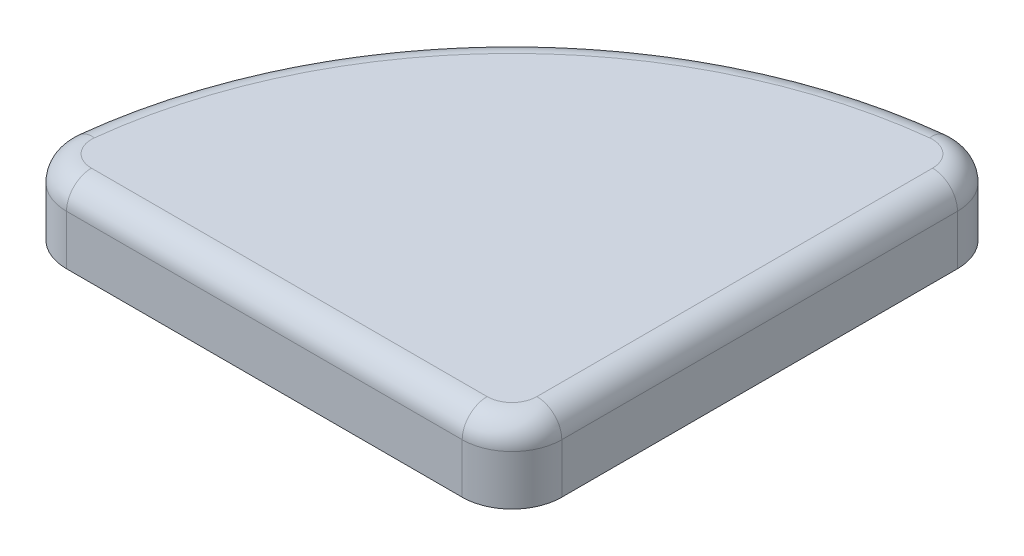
ISO-10303-21;
HEADER;
FILE_DESCRIPTION(('STEP AP214'),'2;1');
FILE_NAME('part.step','',(''),(''),'','','');
FILE_SCHEMA(('AUTOMOTIVE_DESIGN { 1 0 10303 214 1 1 1 1 }'));
ENDSEC;
DATA;
#1=APPLICATION_CONTEXT('core data for automotive mechanical design processes');
#2=APPLICATION_PROTOCOL_DEFINITION('international standard','automotive_design',2000,#1);
#3=PRODUCT_CONTEXT('',#1,'mechanical');
#4=PRODUCT('Part','Part','',(#3));
#5=PRODUCT_RELATED_PRODUCT_CATEGORY('part','',(#4));
#6=PRODUCT_DEFINITION_FORMATION('','',#4);
#7=PRODUCT_DEFINITION_CONTEXT('part definition',#1,'design');
#8=PRODUCT_DEFINITION('design','',#6,#7);
#9=PRODUCT_DEFINITION_SHAPE('','',#8);
#10=(LENGTH_UNIT() NAMED_UNIT(*) SI_UNIT(.MILLI.,.METRE.));
#11=(NAMED_UNIT(*) PLANE_ANGLE_UNIT() SI_UNIT($,.RADIAN.));
#12=(NAMED_UNIT(*) SI_UNIT($,.STERADIAN.) SOLID_ANGLE_UNIT());
#13=UNCERTAINTY_MEASURE_WITH_UNIT(LENGTH_MEASURE(1.E-05),#10,'distance_accuracy_value','');
#14=(GEOMETRIC_REPRESENTATION_CONTEXT(3) GLOBAL_UNCERTAINTY_ASSIGNED_CONTEXT((#13)) GLOBAL_UNIT_ASSIGNED_CONTEXT((#10,
#11,#12)) REPRESENTATION_CONTEXT('',''));
#15=CARTESIAN_POINT('',(0.,0.,0.));
#16=DIRECTION('',(0.,0.,1.));
#17=DIRECTION('',(1.,0.,0.));
#18=AXIS2_PLACEMENT_3D('',#15,#16,#17);
#19=CARTESIAN_POINT('',(0.,1.,0.));
#20=DIRECTION('',(0.,-1.,0.));
#21=DIRECTION('',(0.,0.,-1.));
#22=AXIS2_PLACEMENT_3D('',#19,#20,#21);
#23=PLANE('',#22);
#24=DIRECTION('',(1.,0.,0.));
#25=VECTOR('',#24,1.);
#26=CARTESIAN_POINT('',(-12.5,1.,-2.2));
#27=LINE('',#26,#25);
#28=CARTESIAN_POINT('',(-12.5,1.,-2.2));
#29=VERTEX_POINT('',#28);
#30=CARTESIAN_POINT('',(-7.50000000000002,1.,-2.2));
#31=VERTEX_POINT('',#30);
#32=EDGE_CURVE('E253',#29,#31,#27,.T.);
#33=ORIENTED_EDGE('',*,*,#32,.F.);
#34=DIRECTION('',(0.,0.,-1.));
#35=VECTOR('',#34,1.);
#36=CARTESIAN_POINT('',(-12.5,1.,-1.2));
#37=LINE('',#36,#35);
#38=CARTESIAN_POINT('',(-12.5,1.,-1.2));
#39=VERTEX_POINT('',#38);
#40=EDGE_CURVE('E217',#39,#29,#37,.T.);
#41=ORIENTED_EDGE('',*,*,#40,.F.);
#42=DIRECTION('',(-1.,0.,0.));
#43=VECTOR('',#42,1.);
#44=CARTESIAN_POINT('',(-17.8885438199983,1.,-1.19999999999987));
#45=LINE('',#44,#43);
#46=CARTESIAN_POINT('',(-17.8885438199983,1.,-1.19999999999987));
#47=VERTEX_POINT('',#46);
#48=EDGE_CURVE('E284',#39,#47,#45,.T.);
#49=ORIENTED_EDGE('',*,*,#48,.T.);
#50=CARTESIAN_POINT('',(-17.8885438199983,1.,-1.99999999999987));
#51=DIRECTION('',(0.,-1.,0.));
#52=DIRECTION('',(0.,0.,-1.));
#53=AXIS2_PLACEMENT_3D('',#50,#51,#52);
#54=CIRCLE('',#53,0.799999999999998);
#55=CARTESIAN_POINT('',(-18.6835902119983,1.,-2.08888888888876));
#56=VERTEX_POINT('',#55);
#57=EDGE_CURVE('E288',#47,#56,#54,.T.);
#58=ORIENTED_EDGE('',*,*,#57,.T.);
#59=CARTESIAN_POINT('',(0.,1.,0.));
#60=DIRECTION('',(0.,-1.,0.));
#61=DIRECTION('',(0.,0.,-1.));
#62=AXIS2_PLACEMENT_3D('',#59,#60,#61);
#63=CIRCLE('',#62,18.8);
#64=CARTESIAN_POINT('',(-2.08888888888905,1.,-18.6835902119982));
#65=VERTEX_POINT('',#64);
#66=EDGE_CURVE('E271',#56,#65,#63,.T.);
#67=ORIENTED_EDGE('',*,*,#66,.T.);
#68=CARTESIAN_POINT('',(-2.00000000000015,1.,-17.8885438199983));
#69=DIRECTION('',(0.,-1.,0.));
#70=DIRECTION('',(0.,0.,-1.));
#71=AXIS2_PLACEMENT_3D('',#68,#69,#70);
#72=CIRCLE('',#71,0.799999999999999);
#73=CARTESIAN_POINT('',(-1.20000000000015,1.,-17.8885438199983));
#74=VERTEX_POINT('',#73);
#75=EDGE_CURVE('E274',#65,#74,#72,.T.);
#76=ORIENTED_EDGE('',*,*,#75,.T.);
#77=DIRECTION('',(0.,0.,1.));
#78=VECTOR('',#77,1.);
#79=CARTESIAN_POINT('',(-1.20000000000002,1.,-2.00000000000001));
#80=LINE('',#79,#78);
#81=CARTESIAN_POINT('',(-1.20000000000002,1.,-2.00000000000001));
#82=VERTEX_POINT('',#81);
#83=EDGE_CURVE('E278',#74,#82,#80,.T.);
#84=ORIENTED_EDGE('',*,*,#83,.T.);
#85=CARTESIAN_POINT('',(-2.00000000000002,1.,-2.));
#86=DIRECTION('',(0.,-1.,0.));
#87=DIRECTION('',(0.,0.,-1.));
#88=AXIS2_PLACEMENT_3D('',#85,#86,#87);
#89=CIRCLE('',#88,0.8);
#90=CARTESIAN_POINT('',(-2.00000000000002,1.,-1.2));
#91=VERTEX_POINT('',#90);
#92=EDGE_CURVE('E281',#82,#91,#89,.T.);
#93=ORIENTED_EDGE('',*,*,#92,.T.);
#94=CARTESIAN_POINT('',(-7.50000000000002,1.,-1.2));
#95=VERTEX_POINT('',#94);
#96=EDGE_CURVE('E285',#91,#95,#45,.T.);
#97=ORIENTED_EDGE('',*,*,#96,.T.);
#98=DIRECTION('',(0.,0.,1.));
#99=VECTOR('',#98,1.);
#100=CARTESIAN_POINT('',(-7.50000000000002,1.,-1.2));
#101=LINE('',#100,#99);
#102=EDGE_CURVE('E244',#31,#95,#101,.T.);
#103=ORIENTED_EDGE('',*,*,#102,.F.);
#104=EDGE_LOOP('',(#33,#41,#49,#58,#67,#76,#84,#93,#97,#103));
#105=FACE_BOUND('',#104,.T.);
#106=DIRECTION('',(1.,0.,0.));
#107=VECTOR('',#106,1.);
#108=CARTESIAN_POINT('',(-11.3,1.,-12.1499999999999));
#109=LINE('',#108,#107);
#110=CARTESIAN_POINT('',(-11.3,1.,-12.1499999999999));
#111=VERTEX_POINT('',#110);
#112=CARTESIAN_POINT('',(-8.70000000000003,1.,-12.1499999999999));
#113=VERTEX_POINT('',#112);
#114=EDGE_CURVE('E213',#111,#113,#109,.T.);
#115=ORIENTED_EDGE('',*,*,#114,.F.);
#116=DIRECTION('',(0.,0.,-1.));
#117=VECTOR('',#116,1.);
#118=CARTESIAN_POINT('',(-11.3,1.,-7.84999999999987));
#119=LINE('',#118,#117);
#120=CARTESIAN_POINT('',(-11.3,1.,-7.84999999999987));
#121=VERTEX_POINT('',#120);
#122=EDGE_CURVE('E221',#121,#111,#119,.T.);
#123=ORIENTED_EDGE('',*,*,#122,.F.);
#124=DIRECTION('',(-1.,0.,0.));
#125=VECTOR('',#124,1.);
#126=CARTESIAN_POINT('',(-11.3,1.,-7.84999999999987));
#127=LINE('',#126,#125);
#128=CARTESIAN_POINT('',(-8.70000000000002,1.,-7.84999999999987));
#129=VERTEX_POINT('',#128);
#130=EDGE_CURVE('E232',#129,#121,#127,.T.);
#131=ORIENTED_EDGE('',*,*,#130,.F.);
#132=DIRECTION('',(0.,0.,1.));
#133=VECTOR('',#132,1.);
#134=CARTESIAN_POINT('',(-8.70000000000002,1.,-7.84999999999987));
#135=LINE('',#134,#133);
#136=EDGE_CURVE('E230',#113,#129,#135,.T.);
#137=ORIENTED_EDGE('',*,*,#136,.F.);
#138=EDGE_LOOP('',(#115,#123,#131,#137));
#139=FACE_BOUND('',#138,.T.);
#140=ADVANCED_FACE('F37',(#105,#139),#23,.T.);
#141=CARTESIAN_POINT('',(-17.8885438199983,1.,-1.19999999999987));
#142=DIRECTION('',(0.,0.,1.));
#143=DIRECTION('',(1.,0.,0.));
#144=AXIS2_PLACEMENT_3D('',#141,#142,#143);
#145=PLANE('',#144);
#146=DIRECTION('',(0.,1.,0.));
#147=VECTOR('',#146,1.);
#148=CARTESIAN_POINT('',(-12.5,-1.,-1.2));
#149=LINE('',#148,#147);
#150=CARTESIAN_POINT('',(-12.5,0.,-1.2));
#151=VERTEX_POINT('',#150);
#152=EDGE_CURVE('E250',#151,#39,#149,.T.);
#153=ORIENTED_EDGE('',*,*,#152,.F.);
#154=DIRECTION('',(-1.,0.,0.));
#155=VECTOR('',#154,1.);
#156=CARTESIAN_POINT('',(-17.8885438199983,0.,-1.19999999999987));
#157=LINE('',#156,#155);
#158=CARTESIAN_POINT('',(-17.8885438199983,0.,-1.19999999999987));
#159=VERTEX_POINT('',#158);
#160=EDGE_CURVE('E302',#151,#159,#157,.T.);
#161=ORIENTED_EDGE('',*,*,#160,.T.);
#162=DIRECTION('',(0.,-1.,0.));
#163=VECTOR('',#162,1.);
#164=CARTESIAN_POINT('',(-17.8885438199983,1.,-1.19999999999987));
#165=LINE('',#164,#163);
#166=EDGE_CURVE('E311',#47,#159,#165,.T.);
#167=ORIENTED_EDGE('',*,*,#166,.F.);
#168=ORIENTED_EDGE('',*,*,#48,.F.);
#169=EDGE_LOOP('',(#153,#161,#167,#168));
#170=FACE_BOUND('',#169,.T.);
#171=ADVANCED_FACE('F443',(#170),#145,.F.);
#172=DIRECTION('',(0.,1.,0.));
#173=VECTOR('',#172,1.);
#174=CARTESIAN_POINT('',(-7.50000000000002,-1.,-1.2));
#175=LINE('',#174,#173);
#176=CARTESIAN_POINT('',(-7.50000000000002,0.,-1.2));
#177=VERTEX_POINT('',#176);
#178=EDGE_CURVE('E260',#177,#95,#175,.T.);
#179=ORIENTED_EDGE('',*,*,#178,.T.);
#180=ORIENTED_EDGE('',*,*,#96,.F.);
#181=DIRECTION('',(0.,-1.,0.));
#182=VECTOR('',#181,1.);
#183=CARTESIAN_POINT('',(-2.00000000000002,1.,-1.2));
#184=LINE('',#183,#182);
#185=CARTESIAN_POINT('',(-2.00000000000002,0.,-1.2));
#186=VERTEX_POINT('',#185);
#187=EDGE_CURVE('E314',#91,#186,#184,.T.);
#188=ORIENTED_EDGE('',*,*,#187,.T.);
#189=EDGE_CURVE('E303',#186,#177,#157,.T.);
#190=ORIENTED_EDGE('',*,*,#189,.T.);
#191=EDGE_LOOP('',(#179,#180,#188,#190));
#192=FACE_BOUND('',#191,.T.);
#193=ADVANCED_FACE('F450',(#192),#145,.F.);
#194=CARTESIAN_POINT('',(0.,3.,0.));
#195=DIRECTION('',(0.,-1.,0.));
#196=DIRECTION('',(0.,0.,-1.));
#197=AXIS2_PLACEMENT_3D('',#194,#195,#196);
#198=CYLINDRICAL_SURFACE('',#197,20.);
#199=DIRECTION('',(0.,-1.,0.));
#200=VECTOR('',#199,1.);
#201=CARTESIAN_POINT('',(-19.8761597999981,3.,-2.22222222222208));
#202=LINE('',#201,#200);
#203=CARTESIAN_POINT('',(-19.8761597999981,2.,-2.22222222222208));
#204=VERTEX_POINT('',#203);
#205=CARTESIAN_POINT('',(-19.8761597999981,0.,-2.22222222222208));
#206=VERTEX_POINT('',#205);
#207=EDGE_CURVE('E351',#204,#206,#202,.T.);
#208=ORIENTED_EDGE('',*,*,#207,.F.);
#209=CARTESIAN_POINT('',(0.,2.,0.));
#210=DIRECTION('',(0.,1.,0.));
#211=DIRECTION('',(0.,0.,1.));
#212=AXIS2_PLACEMENT_3D('',#209,#210,#211);
#213=CIRCLE('',#212,20.);
#214=CARTESIAN_POINT('',(-2.22222222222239,2.,-19.8761597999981));
#215=VERTEX_POINT('',#214);
#216=EDGE_CURVE('E377',#204,#215,#213,.F.);
#217=ORIENTED_EDGE('',*,*,#216,.T.);
#218=DIRECTION('',(0.,-1.,0.));
#219=VECTOR('',#218,1.);
#220=CARTESIAN_POINT('',(-2.22222222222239,3.,-19.8761597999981));
#221=LINE('',#220,#219);
#222=CARTESIAN_POINT('',(-2.22222222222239,0.,-19.8761597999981));
#223=VERTEX_POINT('',#222);
#224=EDGE_CURVE('E341',#215,#223,#221,.T.);
#225=ORIENTED_EDGE('',*,*,#224,.T.);
#226=CARTESIAN_POINT('',(0.,0.,0.));
#227=DIRECTION('',(0.,1.,0.));
#228=DIRECTION('',(0.,0.,1.));
#229=AXIS2_PLACEMENT_3D('',#226,#227,#228);
#230=CIRCLE('',#229,20.);
#231=EDGE_CURVE('E322',#223,#206,#230,.T.);
#232=ORIENTED_EDGE('',*,*,#231,.T.);
#233=EDGE_LOOP('',(#208,#217,#225,#232));
#234=FACE_BOUND('',#233,.T.);
#235=ADVANCED_FACE('F508',(#234),#198,.T.);
#236=CARTESIAN_POINT('',(-17.8885438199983,3.,-1.99999999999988));
#237=DIRECTION('',(0.,-1.,0.));
#238=DIRECTION('',(0.,0.,-1.));
#239=AXIS2_PLACEMENT_3D('',#236,#237,#238);
#240=CYLINDRICAL_SURFACE('',#239,2.);
#241=DIRECTION('',(0.,-1.,0.));
#242=VECTOR('',#241,1.);
#243=CARTESIAN_POINT('',(-17.8885438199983,3.,1.25333771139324E-13));
#244=LINE('',#243,#242);
#245=CARTESIAN_POINT('',(-17.8885438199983,2.,1.25333771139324E-13));
#246=VERTEX_POINT('',#245);
#247=CARTESIAN_POINT('',(-17.8885438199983,0.,1.25333771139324E-13));
#248=VERTEX_POINT('',#247);
#249=EDGE_CURVE('E349',#246,#248,#244,.T.);
#250=ORIENTED_EDGE('',*,*,#249,.F.);
#251=CARTESIAN_POINT('',(-17.8885438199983,2.,-1.99999999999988));
#252=DIRECTION('',(0.,1.,0.));
#253=DIRECTION('',(0.,0.,1.));
#254=AXIS2_PLACEMENT_3D('',#251,#252,#253);
#255=CIRCLE('',#254,2.);
#256=EDGE_CURVE('E375',#246,#204,#255,.F.);
#257=ORIENTED_EDGE('',*,*,#256,.T.);
#258=ORIENTED_EDGE('',*,*,#207,.T.);
#259=CARTESIAN_POINT('',(-17.8885438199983,0.,-1.99999999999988));
#260=DIRECTION('',(0.,1.,0.));
#261=DIRECTION('',(0.,0.,1.));
#262=AXIS2_PLACEMENT_3D('',#259,#260,#261);
#263=CIRCLE('',#262,2.);
#264=EDGE_CURVE('E325',#206,#248,#263,.T.);
#265=ORIENTED_EDGE('',*,*,#264,.T.);
#266=EDGE_LOOP('',(#250,#257,#258,#265));
#267=FACE_BOUND('',#266,.T.);
#268=ADVANCED_FACE('F504',(#267),#240,.T.);
#269=CARTESIAN_POINT('',(-2.00000000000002,3.,0.));
#270=DIRECTION('',(0.,0.,-1.));
#271=DIRECTION('',(-1.,0.,0.));
#272=AXIS2_PLACEMENT_3D('',#269,#270,#271);
#273=PLANE('',#272);
#274=DIRECTION('',(0.,-1.,0.));
#275=VECTOR('',#274,1.);
#276=CARTESIAN_POINT('',(-2.00000000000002,3.,0.));
#277=LINE('',#276,#275);
#278=CARTESIAN_POINT('',(-2.00000000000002,2.,0.));
#279=VERTEX_POINT('',#278);
#280=CARTESIAN_POINT('',(-2.00000000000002,0.,0.));
#281=VERTEX_POINT('',#280);
#282=EDGE_CURVE('E347',#279,#281,#277,.T.);
#283=ORIENTED_EDGE('',*,*,#282,.F.);
#284=DIRECTION('',(1.,0.,0.));
#285=VECTOR('',#284,1.);
#286=CARTESIAN_POINT('',(-17.8885438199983,2.,1.24700109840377E-13));
#287=LINE('',#286,#285);
#288=EDGE_CURVE('E373',#279,#246,#287,.F.);
#289=ORIENTED_EDGE('',*,*,#288,.T.);
#290=ORIENTED_EDGE('',*,*,#249,.T.);
#291=DIRECTION('',(1.,0.,0.));
#292=VECTOR('',#291,1.);
#293=CARTESIAN_POINT('',(-2.00000000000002,0.,0.));
#294=LINE('',#293,#292);
#295=EDGE_CURVE('E329',#248,#281,#294,.T.);
#296=ORIENTED_EDGE('',*,*,#295,.T.);
#297=EDGE_LOOP('',(#283,#289,#290,#296));
#298=FACE_BOUND('',#297,.T.);
#299=ADVANCED_FACE('F500',(#298),#273,.F.);
#300=CARTESIAN_POINT('',(-2.00000000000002,3.,-1.99999999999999));
#301=DIRECTION('',(0.,-1.,0.));
#302=DIRECTION('',(0.,0.,-1.));
#303=AXIS2_PLACEMENT_3D('',#300,#301,#302);
#304=CYLINDRICAL_SURFACE('',#303,1.99999999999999);
#305=DIRECTION('',(0.,-1.,0.));
#306=VECTOR('',#305,1.);
#307=CARTESIAN_POINT('',(0.,3.,-2.00000000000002));
#308=LINE('',#307,#306);
#309=CARTESIAN_POINT('',(0.,2.,-2.00000000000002));
#310=VERTEX_POINT('',#309);
#311=CARTESIAN_POINT('',(0.,0.,-2.00000000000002));
#312=VERTEX_POINT('',#311);
#313=EDGE_CURVE('E345',#310,#312,#308,.T.);
#314=ORIENTED_EDGE('',*,*,#313,.F.);
#315=CARTESIAN_POINT('',(-2.00000000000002,2.,-1.99999999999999));
#316=DIRECTION('',(0.,1.,0.));
#317=DIRECTION('',(0.,0.,1.));
#318=AXIS2_PLACEMENT_3D('',#315,#316,#317);
#319=CIRCLE('',#318,1.99999999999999);
#320=EDGE_CURVE('E371',#310,#279,#319,.F.);
#321=ORIENTED_EDGE('',*,*,#320,.T.);
#322=ORIENTED_EDGE('',*,*,#282,.T.);
#323=CARTESIAN_POINT('',(-2.00000000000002,0.,-1.99999999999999));
#324=DIRECTION('',(0.,1.,0.));
#325=DIRECTION('',(0.,0.,1.));
#326=AXIS2_PLACEMENT_3D('',#323,#324,#325);
#327=CIRCLE('',#326,1.99999999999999);
#328=EDGE_CURVE('E332',#281,#312,#327,.T.);
#329=ORIENTED_EDGE('',*,*,#328,.T.);
#330=EDGE_LOOP('',(#314,#321,#322,#329));
#331=FACE_BOUND('',#330,.T.);
#332=ADVANCED_FACE('F496',(#331),#304,.T.);
#333=CARTESIAN_POINT('',(-1.49619899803E-13,3.,-17.8885438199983));
#334=DIRECTION('',(-1.,0.,0.));
#335=DIRECTION('',(0.,0.,1.));
#336=AXIS2_PLACEMENT_3D('',#333,#334,#335);
#337=PLANE('',#336);
#338=DIRECTION('',(0.,-1.,0.));
#339=VECTOR('',#338,1.);
#340=CARTESIAN_POINT('',(-1.49619899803E-13,3.,-17.8885438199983));
#341=LINE('',#340,#339);
#342=CARTESIAN_POINT('',(-1.49619899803E-13,2.,-17.8885438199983));
#343=VERTEX_POINT('',#342);
#344=CARTESIAN_POINT('',(-1.49619899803E-13,0.,-17.8885438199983));
#345=VERTEX_POINT('',#344);
#346=EDGE_CURVE('E343',#343,#345,#341,.T.);
#347=ORIENTED_EDGE('',*,*,#346,.F.);
#348=DIRECTION('',(0.,0.,-1.));
#349=VECTOR('',#348,1.);
#350=CARTESIAN_POINT('',(0.,2.,-2.00000000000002));
#351=LINE('',#350,#349);
#352=EDGE_CURVE('E369',#343,#310,#351,.F.);
#353=ORIENTED_EDGE('',*,*,#352,.T.);
#354=ORIENTED_EDGE('',*,*,#313,.T.);
#355=DIRECTION('',(0.,0.,-1.));
#356=VECTOR('',#355,1.);
#357=CARTESIAN_POINT('',(-1.49619899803E-13,0.,-17.8885438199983));
#358=LINE('',#357,#356);
#359=EDGE_CURVE('E335',#312,#345,#358,.T.);
#360=ORIENTED_EDGE('',*,*,#359,.T.);
#361=EDGE_LOOP('',(#347,#353,#354,#360));
#362=FACE_BOUND('',#361,.T.);
#363=ADVANCED_FACE('F492',(#362),#337,.F.);
#364=CARTESIAN_POINT('',(-2.00000000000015,3.,-17.8885438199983));
#365=DIRECTION('',(0.,-1.,0.));
#366=DIRECTION('',(0.,0.,-1.));
#367=AXIS2_PLACEMENT_3D('',#364,#365,#366);
#368=CYLINDRICAL_SURFACE('',#367,2.);
#369=ORIENTED_EDGE('',*,*,#224,.F.);
#370=CARTESIAN_POINT('',(-2.00000000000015,2.,-17.8885438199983));
#371=DIRECTION('',(0.,1.,0.));
#372=DIRECTION('',(0.,0.,1.));
#373=AXIS2_PLACEMENT_3D('',#370,#371,#372);
#374=CIRCLE('',#373,2.);
#375=EDGE_CURVE('E366',#215,#343,#374,.F.);
#376=ORIENTED_EDGE('',*,*,#375,.T.);
#377=ORIENTED_EDGE('',*,*,#346,.T.);
#378=CARTESIAN_POINT('',(-2.00000000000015,0.,-17.8885438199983));
#379=DIRECTION('',(0.,1.,0.));
#380=DIRECTION('',(0.,0.,1.));
#381=AXIS2_PLACEMENT_3D('',#378,#379,#380);
#382=CIRCLE('',#381,2.);
#383=EDGE_CURVE('E338',#345,#223,#382,.T.);
#384=ORIENTED_EDGE('',*,*,#383,.T.);
#385=EDGE_LOOP('',(#369,#376,#377,#384));
#386=FACE_BOUND('',#385,.T.);
#387=ADVANCED_FACE('F484',(#386),#368,.T.);
#388=CARTESIAN_POINT('',(0.,3.,0.));
#389=DIRECTION('',(0.,1.,0.));
#390=DIRECTION('',(0.,0.,1.));
#391=AXIS2_PLACEMENT_3D('',#388,#389,#390);
#392=PLANE('',#391);
#393=DIRECTION('',(0.,0.,-1.));
#394=VECTOR('',#393,1.);
#395=CARTESIAN_POINT('',(-1.00000000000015,3.,-17.8885438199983));
#396=LINE('',#395,#394);
#397=CARTESIAN_POINT('',(-1.00000000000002,3.,-2.00000000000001));
#398=VERTEX_POINT('',#397);
#399=CARTESIAN_POINT('',(-1.00000000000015,3.,-17.8885438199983));
#400=VERTEX_POINT('',#399);
#401=EDGE_CURVE('E361',#398,#400,#396,.T.);
#402=ORIENTED_EDGE('',*,*,#401,.T.);
#403=CARTESIAN_POINT('',(-2.00000000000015,3.,-17.8885438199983));
#404=DIRECTION('',(0.,1.,0.));
#405=DIRECTION('',(0.,0.,1.));
#406=AXIS2_PLACEMENT_3D('',#403,#404,#405);
#407=CIRCLE('',#406,1.);
#408=CARTESIAN_POINT('',(-2.11111111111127,3.,-18.8823518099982));
#409=VERTEX_POINT('',#408);
#410=EDGE_CURVE('E363',#400,#409,#407,.T.);
#411=ORIENTED_EDGE('',*,*,#410,.T.);
#412=CARTESIAN_POINT('',(0.,3.,0.));
#413=DIRECTION('',(0.,1.,0.));
#414=DIRECTION('',(0.,0.,1.));
#415=AXIS2_PLACEMENT_3D('',#412,#413,#414);
#416=CIRCLE('',#415,19.);
#417=CARTESIAN_POINT('',(-18.8823518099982,3.,-2.11111111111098));
#418=VERTEX_POINT('',#417);
#419=EDGE_CURVE('E353',#409,#418,#416,.T.);
#420=ORIENTED_EDGE('',*,*,#419,.T.);
#421=CARTESIAN_POINT('',(-17.8885438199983,3.,-1.99999999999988));
#422=DIRECTION('',(0.,1.,0.));
#423=DIRECTION('',(0.,0.,1.));
#424=AXIS2_PLACEMENT_3D('',#421,#422,#423);
#425=CIRCLE('',#424,1.);
#426=CARTESIAN_POINT('',(-17.8885438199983,3.,-0.999999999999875));
#427=VERTEX_POINT('',#426);
#428=EDGE_CURVE('E355',#418,#427,#425,.T.);
#429=ORIENTED_EDGE('',*,*,#428,.T.);
#430=DIRECTION('',(1.,0.,0.));
#431=VECTOR('',#430,1.);
#432=CARTESIAN_POINT('',(-2.00000000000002,3.,-1.));
#433=LINE('',#432,#431);
#434=CARTESIAN_POINT('',(-2.00000000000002,3.,-1.));
#435=VERTEX_POINT('',#434);
#436=EDGE_CURVE('E357',#427,#435,#433,.T.);
#437=ORIENTED_EDGE('',*,*,#436,.T.);
#438=CARTESIAN_POINT('',(-2.00000000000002,3.,-1.99999999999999));
#439=DIRECTION('',(0.,1.,0.));
#440=DIRECTION('',(0.,0.,1.));
#441=AXIS2_PLACEMENT_3D('',#438,#439,#440);
#442=CIRCLE('',#441,0.999999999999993);
#443=EDGE_CURVE('E359',#435,#398,#442,.T.);
#444=ORIENTED_EDGE('',*,*,#443,.T.);
#445=EDGE_LOOP('',(#402,#411,#420,#429,#437,#444));
#446=FACE_BOUND('',#445,.T.);
#447=ADVANCED_FACE('F480',(#446),#392,.T.);
#448=CARTESIAN_POINT('',(0.,0.,0.));
#449=DIRECTION('',(0.,1.,0.));
#450=DIRECTION('',(0.,0.,1.));
#451=AXIS2_PLACEMENT_3D('',#448,#449,#450);
#452=PLANE('',#451);
#453=CARTESIAN_POINT('',(-2.00000000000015,0.,-17.8885438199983));
#454=DIRECTION('',(0.,-1.,0.));
#455=DIRECTION('',(0.,0.,-1.));
#456=AXIS2_PLACEMENT_3D('',#453,#454,#455);
#457=CIRCLE('',#456,0.799999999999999);
#458=CARTESIAN_POINT('',(-2.08888888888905,0.,-18.6835902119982));
#459=VERTEX_POINT('',#458);
#460=CARTESIAN_POINT('',(-1.20000000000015,0.,-17.8885438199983));
#461=VERTEX_POINT('',#460);
#462=EDGE_CURVE('E293',#459,#461,#457,.T.);
#463=ORIENTED_EDGE('',*,*,#462,.F.);
#464=CARTESIAN_POINT('',(0.,0.,0.));
#465=DIRECTION('',(0.,-1.,0.));
#466=DIRECTION('',(0.,0.,-1.));
#467=AXIS2_PLACEMENT_3D('',#464,#465,#466);
#468=CIRCLE('',#467,18.8);
#469=CARTESIAN_POINT('',(-18.6835902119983,0.,-2.08888888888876));
#470=VERTEX_POINT('',#469);
#471=EDGE_CURVE('E270',#470,#459,#468,.T.);
#472=ORIENTED_EDGE('',*,*,#471,.F.);
#473=CARTESIAN_POINT('',(-17.8885438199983,0.,-1.99999999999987));
#474=DIRECTION('',(0.,-1.,0.));
#475=DIRECTION('',(0.,0.,-1.));
#476=AXIS2_PLACEMENT_3D('',#473,#474,#475);
#477=CIRCLE('',#476,0.799999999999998);
#478=EDGE_CURVE('E275',#159,#470,#477,.T.);
#479=ORIENTED_EDGE('',*,*,#478,.F.);
#480=ORIENTED_EDGE('',*,*,#160,.F.);
#481=DIRECTION('',(-1.,0.,0.));
#482=VECTOR('',#481,1.);
#483=CARTESIAN_POINT('',(0.,0.,-1.2));
#484=LINE('',#483,#482);
#485=EDGE_CURVE('E268',#177,#151,#484,.T.);
#486=ORIENTED_EDGE('',*,*,#485,.F.);
#487=ORIENTED_EDGE('',*,*,#189,.F.);
#488=CARTESIAN_POINT('',(-2.00000000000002,0.,-2.));
#489=DIRECTION('',(0.,-1.,0.));
#490=DIRECTION('',(0.,0.,-1.));
#491=AXIS2_PLACEMENT_3D('',#488,#489,#490);
#492=CIRCLE('',#491,0.8);
#493=CARTESIAN_POINT('',(-1.20000000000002,0.,-2.00000000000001));
#494=VERTEX_POINT('',#493);
#495=EDGE_CURVE('E299',#494,#186,#492,.T.);
#496=ORIENTED_EDGE('',*,*,#495,.F.);
#497=DIRECTION('',(0.,0.,1.));
#498=VECTOR('',#497,1.);
#499=CARTESIAN_POINT('',(-1.20000000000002,0.,-2.00000000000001));
#500=LINE('',#499,#498);
#501=EDGE_CURVE('E296',#461,#494,#500,.T.);
#502=ORIENTED_EDGE('',*,*,#501,.F.);
#503=EDGE_LOOP('',(#463,#472,#479,#480,#486,#487,#496,#502));
#504=FACE_BOUND('',#503,.T.);
#505=ORIENTED_EDGE('',*,*,#231,.F.);
#506=ORIENTED_EDGE('',*,*,#383,.F.);
#507=ORIENTED_EDGE('',*,*,#359,.F.);
#508=ORIENTED_EDGE('',*,*,#328,.F.);
#509=ORIENTED_EDGE('',*,*,#295,.F.);
#510=ORIENTED_EDGE('',*,*,#264,.F.);
#511=EDGE_LOOP('',(#505,#506,#507,#508,#509,#510));
#512=FACE_BOUND('',#511,.T.);
#513=ADVANCED_FACE('F483',(#504,#512),#452,.F.);
#514=CARTESIAN_POINT('',(0.,2.,-1.00000000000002));
#515=DIRECTION('',(-1.,0.,0.));
#516=DIRECTION('',(0.,0.,1.));
#517=AXIS2_PLACEMENT_3D('',#514,#515,#516);
#518=CYLINDRICAL_SURFACE('',#517,1.);
#519=CARTESIAN_POINT('',(-17.8885438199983,2.,-0.999999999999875));
#520=DIRECTION('',(-1.,0.,0.));
#521=DIRECTION('',(0.,0.,1.));
#522=AXIS2_PLACEMENT_3D('',#519,#520,#521);
#523=CIRCLE('',#522,1.);
#524=EDGE_CURVE('E389',#246,#427,#523,.T.);
#525=ORIENTED_EDGE('',*,*,#524,.F.);
#526=ORIENTED_EDGE('',*,*,#288,.F.);
#527=CARTESIAN_POINT('',(-2.00000000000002,2.,-1.));
#528=DIRECTION('',(1.,0.,0.));
#529=DIRECTION('',(0.,0.,-1.));
#530=AXIS2_PLACEMENT_3D('',#527,#528,#529);
#531=CIRCLE('',#530,1.);
#532=EDGE_CURVE('E326',#435,#279,#531,.T.);
#533=ORIENTED_EDGE('',*,*,#532,.F.);
#534=ORIENTED_EDGE('',*,*,#436,.F.);
#535=EDGE_LOOP('',(#525,#526,#533,#534));
#536=FACE_BOUND('',#535,.T.);
#537=ADVANCED_FACE('F488',(#536),#518,.T.);
#538=CARTESIAN_POINT('',(-2.00000000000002,2.,-1.99999999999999));
#539=DIRECTION('',(0.,1.,0.));
#540=DIRECTION('',(0.,0.,1.));
#541=AXIS2_PLACEMENT_3D('',#538,#539,#540);
#542=DEGENERATE_TOROIDAL_SURFACE('',#541,0.999999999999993,1.,.T.);
#543=ORIENTED_EDGE('',*,*,#532,.T.);
#544=ORIENTED_EDGE('',*,*,#320,.F.);
#545=CARTESIAN_POINT('',(-1.00000000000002,2.,-2.00000000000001));
#546=DIRECTION('',(0.,0.,-1.));
#547=DIRECTION('',(-1.,0.,0.));
#548=AXIS2_PLACEMENT_3D('',#545,#546,#547);
#549=CIRCLE('',#548,1.);
#550=EDGE_CURVE('E386',#398,#310,#549,.T.);
#551=ORIENTED_EDGE('',*,*,#550,.F.);
#552=ORIENTED_EDGE('',*,*,#443,.F.);
#553=EDGE_LOOP('',(#543,#544,#551,#552));
#554=FACE_BOUND('',#553,.T.);
#555=ADVANCED_FACE('F527',(#554),#542,.T.);
#556=CARTESIAN_POINT('',(-17.8885438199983,2.,-1.99999999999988));
#557=DIRECTION('',(0.,1.,0.));
#558=DIRECTION('',(0.,0.,1.));
#559=AXIS2_PLACEMENT_3D('',#556,#557,#558);
#560=TOROIDAL_SURFACE('',#559,1.,1.);
#561=ORIENTED_EDGE('',*,*,#524,.T.);
#562=ORIENTED_EDGE('',*,*,#428,.F.);
#563=CARTESIAN_POINT('',(-18.8823518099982,2.,-2.11111111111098));
#564=DIRECTION('',(0.111111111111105,0.,-0.993807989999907));
#565=DIRECTION('',(-0.993807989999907,0.,-0.111111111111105));
#566=AXIS2_PLACEMENT_3D('',#563,#564,#565);
#567=CIRCLE('',#566,1.);
#568=EDGE_CURVE('E383',#204,#418,#567,.T.);
#569=ORIENTED_EDGE('',*,*,#568,.F.);
#570=ORIENTED_EDGE('',*,*,#256,.F.);
#571=EDGE_LOOP('',(#561,#562,#569,#570));
#572=FACE_BOUND('',#571,.T.);
#573=ADVANCED_FACE('F523',(#572),#560,.T.);
#574=CARTESIAN_POINT('',(-1.,2.,0.));
#575=DIRECTION('',(0.,0.,1.));
#576=DIRECTION('',(1.,0.,0.));
#577=AXIS2_PLACEMENT_3D('',#574,#575,#576);
#578=CYLINDRICAL_SURFACE('',#577,1.);
#579=ORIENTED_EDGE('',*,*,#550,.T.);
#580=ORIENTED_EDGE('',*,*,#352,.F.);
#581=CARTESIAN_POINT('',(-1.00000000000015,2.,-17.8885438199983));
#582=DIRECTION('',(0.,0.,-1.));
#583=DIRECTION('',(-1.,0.,0.));
#584=AXIS2_PLACEMENT_3D('',#581,#582,#583);
#585=CIRCLE('',#584,1.);
#586=EDGE_CURVE('E381',#400,#343,#585,.T.);
#587=ORIENTED_EDGE('',*,*,#586,.F.);
#588=ORIENTED_EDGE('',*,*,#401,.F.);
#589=EDGE_LOOP('',(#579,#580,#587,#588));
#590=FACE_BOUND('',#589,.T.);
#591=ADVANCED_FACE('F519',(#590),#578,.T.);
#592=CARTESIAN_POINT('',(0.,2.,0.));
#593=DIRECTION('',(0.,1.,0.));
#594=DIRECTION('',(0.,0.,1.));
#595=AXIS2_PLACEMENT_3D('',#592,#593,#594);
#596=TOROIDAL_SURFACE('',#595,19.,1.);
#597=ORIENTED_EDGE('',*,*,#568,.T.);
#598=ORIENTED_EDGE('',*,*,#419,.F.);
#599=CARTESIAN_POINT('',(-2.11111111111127,2.,-18.8823518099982));
#600=DIRECTION('',(0.993807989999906,0.,-0.11111111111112));
#601=DIRECTION('',(-0.11111111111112,0.,-0.993807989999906));
#602=AXIS2_PLACEMENT_3D('',#599,#600,#601);
#603=CIRCLE('',#602,1.);
#604=EDGE_CURVE('E310',#215,#409,#603,.T.);
#605=ORIENTED_EDGE('',*,*,#604,.F.);
#606=ORIENTED_EDGE('',*,*,#216,.F.);
#607=EDGE_LOOP('',(#597,#598,#605,#606));
#608=FACE_BOUND('',#607,.T.);
#609=ADVANCED_FACE('F515',(#608),#596,.T.);
#610=CARTESIAN_POINT('',(-2.00000000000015,2.,-17.8885438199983));
#611=DIRECTION('',(0.,1.,0.));
#612=DIRECTION('',(0.,0.,1.));
#613=AXIS2_PLACEMENT_3D('',#610,#611,#612);
#614=TOROIDAL_SURFACE('',#613,1.,1.);
#615=ORIENTED_EDGE('',*,*,#586,.T.);
#616=ORIENTED_EDGE('',*,*,#375,.F.);
#617=ORIENTED_EDGE('',*,*,#604,.T.);
#618=ORIENTED_EDGE('',*,*,#410,.F.);
#619=EDGE_LOOP('',(#615,#616,#617,#618));
#620=FACE_BOUND('',#619,.T.);
#621=ADVANCED_FACE('F478',(#620),#614,.T.);
#622=CARTESIAN_POINT('',(0.,1.,0.));
#623=DIRECTION('',(0.,-1.,0.));
#624=DIRECTION('',(0.,0.,-1.));
#625=AXIS2_PLACEMENT_3D('',#622,#623,#624);
#626=CYLINDRICAL_SURFACE('',#625,18.8);
#627=ORIENTED_EDGE('',*,*,#471,.T.);
#628=DIRECTION('',(0.,-1.,0.));
#629=VECTOR('',#628,1.);
#630=CARTESIAN_POINT('',(-2.08888888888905,1.,-18.6835902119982));
#631=LINE('',#630,#629);
#632=EDGE_CURVE('E291',#65,#459,#631,.T.);
#633=ORIENTED_EDGE('',*,*,#632,.F.);
#634=ORIENTED_EDGE('',*,*,#66,.F.);
#635=DIRECTION('',(0.,-1.,0.));
#636=VECTOR('',#635,1.);
#637=CARTESIAN_POINT('',(-18.6835902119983,1.,-2.08888888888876));
#638=LINE('',#637,#636);
#639=EDGE_CURVE('E308',#56,#470,#638,.T.);
#640=ORIENTED_EDGE('',*,*,#639,.T.);
#641=EDGE_LOOP('',(#627,#633,#634,#640));
#642=FACE_BOUND('',#641,.T.);
#643=ADVANCED_FACE('F461',(#642),#626,.F.);
#644=CARTESIAN_POINT('',(-17.8885438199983,1.,-1.99999999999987));
#645=DIRECTION('',(0.,-1.,0.));
#646=DIRECTION('',(0.,0.,-1.));
#647=AXIS2_PLACEMENT_3D('',#644,#645,#646);
#648=CYLINDRICAL_SURFACE('',#647,0.799999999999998);
#649=ORIENTED_EDGE('',*,*,#478,.T.);
#650=ORIENTED_EDGE('',*,*,#639,.F.);
#651=ORIENTED_EDGE('',*,*,#57,.F.);
#652=ORIENTED_EDGE('',*,*,#166,.T.);
#653=EDGE_LOOP('',(#649,#650,#651,#652));
#654=FACE_BOUND('',#653,.T.);
#655=ADVANCED_FACE('F458',(#654),#648,.F.);
#656=CARTESIAN_POINT('',(-2.00000000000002,1.,-2.));
#657=DIRECTION('',(0.,-1.,0.));
#658=DIRECTION('',(0.,0.,-1.));
#659=AXIS2_PLACEMENT_3D('',#656,#657,#658);
#660=CYLINDRICAL_SURFACE('',#659,0.8);
#661=ORIENTED_EDGE('',*,*,#495,.T.);
#662=ORIENTED_EDGE('',*,*,#187,.F.);
#663=ORIENTED_EDGE('',*,*,#92,.F.);
#664=DIRECTION('',(0.,-1.,0.));
#665=VECTOR('',#664,1.);
#666=CARTESIAN_POINT('',(-1.20000000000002,1.,-2.00000000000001));
#667=LINE('',#666,#665);
#668=EDGE_CURVE('E316',#82,#494,#667,.T.);
#669=ORIENTED_EDGE('',*,*,#668,.T.);
#670=EDGE_LOOP('',(#661,#662,#663,#669));
#671=FACE_BOUND('',#670,.T.);
#672=ADVANCED_FACE('F460',(#671),#660,.F.);
#673=CARTESIAN_POINT('',(-1.20000000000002,1.,-2.00000000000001));
#674=DIRECTION('',(1.,0.,0.));
#675=DIRECTION('',(0.,0.,-1.));
#676=AXIS2_PLACEMENT_3D('',#673,#674,#675);
#677=PLANE('',#676);
#678=ORIENTED_EDGE('',*,*,#501,.T.);
#679=ORIENTED_EDGE('',*,*,#668,.F.);
#680=ORIENTED_EDGE('',*,*,#83,.F.);
#681=DIRECTION('',(0.,-1.,0.));
#682=VECTOR('',#681,1.);
#683=CARTESIAN_POINT('',(-1.20000000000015,1.,-17.8885438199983));
#684=LINE('',#683,#682);
#685=EDGE_CURVE('E318',#74,#461,#684,.T.);
#686=ORIENTED_EDGE('',*,*,#685,.T.);
#687=EDGE_LOOP('',(#678,#679,#680,#686));
#688=FACE_BOUND('',#687,.T.);
#689=ADVANCED_FACE('F466',(#688),#677,.F.);
#690=CARTESIAN_POINT('',(-2.00000000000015,1.,-17.8885438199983));
#691=DIRECTION('',(0.,-1.,0.));
#692=DIRECTION('',(0.,0.,-1.));
#693=AXIS2_PLACEMENT_3D('',#690,#691,#692);
#694=CYLINDRICAL_SURFACE('',#693,0.799999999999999);
#695=ORIENTED_EDGE('',*,*,#462,.T.);
#696=ORIENTED_EDGE('',*,*,#685,.F.);
#697=ORIENTED_EDGE('',*,*,#75,.F.);
#698=ORIENTED_EDGE('',*,*,#632,.T.);
#699=EDGE_LOOP('',(#695,#696,#697,#698));
#700=FACE_BOUND('',#699,.T.);
#701=ADVANCED_FACE('F470',(#700),#694,.F.);
#702=CARTESIAN_POINT('',(-12.5,-1.,-1.2));
#703=DIRECTION('',(0.,0.,-1.));
#704=DIRECTION('',(-1.,0.,0.));
#705=AXIS2_PLACEMENT_3D('',#702,#703,#704);
#706=PLANE('',#705);
#707=CARTESIAN_POINT('',(-7.50000000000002,-1.,-1.2));
#708=VERTEX_POINT('',#707);
#709=EDGE_CURVE('E261',#708,#177,#175,.T.);
#710=ORIENTED_EDGE('',*,*,#709,.T.);
#711=ORIENTED_EDGE('',*,*,#485,.T.);
#712=CARTESIAN_POINT('',(-12.5,-1.,-1.2));
#713=VERTEX_POINT('',#712);
#714=EDGE_CURVE('E257',#713,#151,#149,.T.);
#715=ORIENTED_EDGE('',*,*,#714,.F.);
#716=DIRECTION('',(-1.,0.,0.));
#717=VECTOR('',#716,1.);
#718=CARTESIAN_POINT('',(-12.5,-1.,-1.2));
#719=LINE('',#718,#717);
#720=EDGE_CURVE('E248',#708,#713,#719,.T.);
#721=ORIENTED_EDGE('',*,*,#720,.F.);
#722=EDGE_LOOP('',(#710,#711,#715,#721));
#723=FACE_BOUND('',#722,.T.);
#724=ADVANCED_FACE('F474',(#723),#706,.F.);
#725=CARTESIAN_POINT('',(-12.5,-1.,-1.2));
#726=DIRECTION('',(1.,0.,0.));
#727=DIRECTION('',(0.,0.,-1.));
#728=AXIS2_PLACEMENT_3D('',#725,#726,#727);
#729=PLANE('',#728);
#730=ORIENTED_EDGE('',*,*,#40,.T.);
#731=DIRECTION('',(0.,1.,0.));
#732=VECTOR('',#731,1.);
#733=CARTESIAN_POINT('',(-12.5,-1.,-2.2));
#734=LINE('',#733,#732);
#735=CARTESIAN_POINT('',(-12.5,-1.,-2.2));
#736=VERTEX_POINT('',#735);
#737=EDGE_CURVE('E266',#736,#29,#734,.T.);
#738=ORIENTED_EDGE('',*,*,#737,.F.);
#739=DIRECTION('',(0.,0.,-1.));
#740=VECTOR('',#739,1.);
#741=CARTESIAN_POINT('',(-12.5,-1.,-1.2));
#742=LINE('',#741,#740);
#743=EDGE_CURVE('E240',#713,#736,#742,.T.);
#744=ORIENTED_EDGE('',*,*,#743,.F.);
#745=ORIENTED_EDGE('',*,*,#714,.T.);
#746=ORIENTED_EDGE('',*,*,#152,.T.);
#747=EDGE_LOOP('',(#730,#738,#744,#745,#746));
#748=FACE_BOUND('',#747,.T.);
#749=ADVANCED_FACE('F456',(#748),#729,.F.);
#750=CARTESIAN_POINT('',(-12.5,-1.,-2.2));
#751=DIRECTION('',(0.,0.,1.));
#752=DIRECTION('',(1.,0.,0.));
#753=AXIS2_PLACEMENT_3D('',#750,#751,#752);
#754=PLANE('',#753);
#755=ORIENTED_EDGE('',*,*,#32,.T.);
#756=DIRECTION('',(0.,1.,0.));
#757=VECTOR('',#756,1.);
#758=CARTESIAN_POINT('',(-7.50000000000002,-1.,-2.2));
#759=LINE('',#758,#757);
#760=CARTESIAN_POINT('',(-7.50000000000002,-1.,-2.2));
#761=VERTEX_POINT('',#760);
#762=EDGE_CURVE('E264',#761,#31,#759,.T.);
#763=ORIENTED_EDGE('',*,*,#762,.F.);
#764=DIRECTION('',(1.,0.,0.));
#765=VECTOR('',#764,1.);
#766=CARTESIAN_POINT('',(-12.5,-1.,-2.2));
#767=LINE('',#766,#765);
#768=EDGE_CURVE('E243',#736,#761,#767,.T.);
#769=ORIENTED_EDGE('',*,*,#768,.F.);
#770=ORIENTED_EDGE('',*,*,#737,.T.);
#771=EDGE_LOOP('',(#755,#763,#769,#770));
#772=FACE_BOUND('',#771,.T.);
#773=ADVANCED_FACE('F612',(#772),#754,.F.);
#774=CARTESIAN_POINT('',(-7.50000000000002,-1.,-1.2));
#775=DIRECTION('',(-1.,0.,0.));
#776=DIRECTION('',(0.,0.,1.));
#777=AXIS2_PLACEMENT_3D('',#774,#775,#776);
#778=PLANE('',#777);
#779=ORIENTED_EDGE('',*,*,#102,.T.);
#780=ORIENTED_EDGE('',*,*,#178,.F.);
#781=ORIENTED_EDGE('',*,*,#709,.F.);
#782=DIRECTION('',(0.,0.,1.));
#783=VECTOR('',#782,1.);
#784=CARTESIAN_POINT('',(-7.50000000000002,-1.,-1.2));
#785=LINE('',#784,#783);
#786=EDGE_CURVE('E246',#761,#708,#785,.T.);
#787=ORIENTED_EDGE('',*,*,#786,.F.);
#788=ORIENTED_EDGE('',*,*,#762,.T.);
#789=EDGE_LOOP('',(#779,#780,#781,#787,#788));
#790=FACE_BOUND('',#789,.T.);
#791=ADVANCED_FACE('F603',(#790),#778,.F.);
#792=CARTESIAN_POINT('',(0.,-1.,0.));
#793=DIRECTION('',(0.,-1.,0.));
#794=DIRECTION('',(0.,0.,-1.));
#795=AXIS2_PLACEMENT_3D('',#792,#793,#794);
#796=PLANE('',#795);
#797=ORIENTED_EDGE('',*,*,#743,.T.);
#798=ORIENTED_EDGE('',*,*,#768,.T.);
#799=ORIENTED_EDGE('',*,*,#786,.T.);
#800=ORIENTED_EDGE('',*,*,#720,.T.);
#801=EDGE_LOOP('',(#797,#798,#799,#800));
#802=FACE_BOUND('',#801,.T.);
#803=ADVANCED_FACE('F592',(#802),#796,.T.);
#804=CARTESIAN_POINT('',(-11.3,1.,-7.84999999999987));
#805=DIRECTION('',(-0.999961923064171,-0.00872653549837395,0.));
#806=DIRECTION('',(0.00872653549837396,-0.999961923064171,0.));
#807=AXIS2_PLACEMENT_3D('',#804,#805,#806);
#808=PLANE('',#807);
#809=DIRECTION('',(-0.00872620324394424,0.999923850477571,-0.00872620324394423));
#810=VECTOR('',#809,1.);
#811=CARTESIAN_POINT('',(-11.3,1.,-12.1499999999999));
#812=LINE('',#811,#810);
#813=CARTESIAN_POINT('',(-11.2475626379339,-5.00872653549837,-12.0975626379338));
#814=VERTEX_POINT('',#813);
#815=EDGE_CURVE('E209',#814,#111,#812,.T.);
#816=ORIENTED_EDGE('',*,*,#815,.F.);
#817=DIRECTION('',(0.,0.,-1.));
#818=VECTOR('',#817,1.);
#819=CARTESIAN_POINT('',(-11.2475626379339,-5.00872653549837,-7.91108807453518));
#820=LINE('',#819,#818);
#821=CARTESIAN_POINT('',(-11.2475626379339,-5.00872653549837,-7.90243736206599));
#822=VERTEX_POINT('',#821);
#823=EDGE_CURVE('E11',#814,#822,#820,.F.);
#824=ORIENTED_EDGE('',*,*,#823,.T.);
#825=DIRECTION('',(-0.00872620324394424,0.999923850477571,0.00872620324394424));
#826=VECTOR('',#825,1.);
#827=CARTESIAN_POINT('',(-11.3,1.,-7.84999999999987));
#828=LINE('',#827,#826);
#829=EDGE_CURVE('E224',#822,#121,#828,.T.);
#830=ORIENTED_EDGE('',*,*,#829,.T.);
#831=ORIENTED_EDGE('',*,*,#122,.T.);
#832=EDGE_LOOP('',(#816,#824,#830,#831));
#833=FACE_BOUND('',#832,.T.);
#834=ADVANCED_FACE('F222',(#833),#808,.T.);
#835=CARTESIAN_POINT('',(-11.3,1.,-12.1499999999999));
#836=DIRECTION('',(0.,-0.00872653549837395,-0.999961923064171));
#837=DIRECTION('',(0.,0.999961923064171,-0.00872653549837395));
#838=AXIS2_PLACEMENT_3D('',#835,#836,#837);
#839=PLANE('',#838);
#840=DIRECTION('',(0.00872620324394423,0.999923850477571,-0.00872620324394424));
#841=VECTOR('',#840,1.);
#842=CARTESIAN_POINT('',(-8.70032743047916,0.962480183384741,-12.1496725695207));
#843=LINE('',#842,#841);
#844=CARTESIAN_POINT('',(-8.75243736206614,-5.00872653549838,-12.0975626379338));
#845=VERTEX_POINT('',#844);
#846=EDGE_CURVE('E218',#845,#113,#843,.T.);
#847=ORIENTED_EDGE('',*,*,#846,.F.);
#848=DIRECTION('',(1.,0.,0.));
#849=VECTOR('',#848,1.);
#850=CARTESIAN_POINT('',(-11.2389119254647,-5.00872653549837,-12.0975626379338));
#851=LINE('',#850,#849);
#852=EDGE_CURVE('E46',#845,#814,#851,.F.);
#853=ORIENTED_EDGE('',*,*,#852,.T.);
#854=ORIENTED_EDGE('',*,*,#815,.T.);
#855=ORIENTED_EDGE('',*,*,#114,.T.);
#856=EDGE_LOOP('',(#847,#853,#854,#855));
#857=FACE_BOUND('',#856,.T.);
#858=ADVANCED_FACE('F211',(#857),#839,.T.);
#859=CARTESIAN_POINT('',(-8.70000000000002,1.,-7.84999999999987));
#860=DIRECTION('',(0.999961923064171,-0.00872653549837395,0.));
#861=DIRECTION('',(0.00872653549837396,0.999961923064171,0.));
#862=AXIS2_PLACEMENT_3D('',#859,#860,#861);
#863=PLANE('',#862);
#864=DIRECTION('',(0.00872620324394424,0.999923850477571,0.00872620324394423));
#865=VECTOR('',#864,1.);
#866=CARTESIAN_POINT('',(-8.70019798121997,0.97731359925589,-7.85019798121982));
#867=LINE('',#866,#865);
#868=CARTESIAN_POINT('',(-8.75243736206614,-5.00872653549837,-7.90243736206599));
#869=VERTEX_POINT('',#868);
#870=EDGE_CURVE('E237',#869,#129,#867,.T.);
#871=ORIENTED_EDGE('',*,*,#870,.F.);
#872=DIRECTION('',(0.,0.,1.));
#873=VECTOR('',#872,1.);
#874=CARTESIAN_POINT('',(-8.75243736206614,-5.00872653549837,-12.0889119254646));
#875=LINE('',#874,#873);
#876=EDGE_CURVE('E61',#869,#845,#875,.F.);
#877=ORIENTED_EDGE('',*,*,#876,.T.);
#878=ORIENTED_EDGE('',*,*,#846,.T.);
#879=ORIENTED_EDGE('',*,*,#136,.T.);
#880=EDGE_LOOP('',(#871,#877,#878,#879));
#881=FACE_BOUND('',#880,.T.);
#882=ADVANCED_FACE('F439',(#881),#863,.T.);
#883=CARTESIAN_POINT('',(-11.3,1.,-7.84999999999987));
#884=DIRECTION('',(0.,-0.00872653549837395,0.999961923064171));
#885=DIRECTION('',(0.,-0.999961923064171,-0.00872653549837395));
#886=AXIS2_PLACEMENT_3D('',#883,#884,#885);
#887=PLANE('',#886);
#888=ORIENTED_EDGE('',*,*,#829,.F.);
#889=DIRECTION('',(-1.,0.,0.));
#890=VECTOR('',#889,1.);
#891=CARTESIAN_POINT('',(-8.76108807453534,-5.00872653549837,-7.90243736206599));
#892=LINE('',#891,#890);
#893=EDGE_CURVE('E402',#822,#869,#892,.F.);
#894=ORIENTED_EDGE('',*,*,#893,.T.);
#895=ORIENTED_EDGE('',*,*,#870,.T.);
#896=ORIENTED_EDGE('',*,*,#130,.T.);
#897=EDGE_LOOP('',(#888,#894,#895,#896));
#898=FACE_BOUND('',#897,.T.);
#899=ADVANCED_FACE('F427',(#898),#887,.T.);
#900=CARTESIAN_POINT('',(0.,-6.,0.));
#901=DIRECTION('',(0.,-1.,0.));
#902=DIRECTION('',(0.,0.,-1.));
#903=AXIS2_PLACEMENT_3D('',#900,#901,#902);
#904=PLANE('',#903);
#905=DIRECTION('',(0.,0.,-1.));
#906=VECTOR('',#905,1.);
#907=CARTESIAN_POINT('',(-9.75239928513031,-6.,-7.91108807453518));
#908=LINE('',#907,#906);
#909=CARTESIAN_POINT('',(-9.75239928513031,-6.,-11.0976007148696));
#910=VERTEX_POINT('',#909);
#911=CARTESIAN_POINT('',(-9.75239928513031,-6.,-8.90239928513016));
#912=VERTEX_POINT('',#911);
#913=EDGE_CURVE('E397',#910,#912,#908,.F.);
#914=ORIENTED_EDGE('',*,*,#913,.T.);
#915=DIRECTION('',(1.,0.,0.));
#916=VECTOR('',#915,1.);
#917=CARTESIAN_POINT('',(-11.2389119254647,-6.,-8.90239928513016));
#918=LINE('',#917,#916);
#919=CARTESIAN_POINT('',(-10.2476007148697,-6.,-8.90239928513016));
#920=VERTEX_POINT('',#919);
#921=EDGE_CURVE('E399',#912,#920,#918,.F.);
#922=ORIENTED_EDGE('',*,*,#921,.T.);
#923=DIRECTION('',(0.,0.,1.));
#924=VECTOR('',#923,1.);
#925=CARTESIAN_POINT('',(-10.2476007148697,-6.,-12.0889119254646));
#926=LINE('',#925,#924);
#927=CARTESIAN_POINT('',(-10.2476007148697,-6.,-11.0976007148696));
#928=VERTEX_POINT('',#927);
#929=EDGE_CURVE('E379',#920,#928,#926,.F.);
#930=ORIENTED_EDGE('',*,*,#929,.T.);
#931=DIRECTION('',(-1.,0.,0.));
#932=VECTOR('',#931,1.);
#933=CARTESIAN_POINT('',(-8.76108807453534,-6.,-11.0976007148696));
#934=LINE('',#933,#932);
#935=EDGE_CURVE('E395',#928,#910,#934,.F.);
#936=ORIENTED_EDGE('',*,*,#935,.T.);
#937=EDGE_LOOP('',(#914,#922,#930,#936));
#938=FACE_BOUND('',#937,.T.);
#939=ADVANCED_FACE('F432',(#938),#904,.T.);
#940=CARTESIAN_POINT('',(0.,-5.,-11.0976007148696));
#941=DIRECTION('',(1.,0.,0.));
#942=DIRECTION('',(0.,0.,-1.));
#943=AXIS2_PLACEMENT_3D('',#940,#941,#942);
#944=CYLINDRICAL_SURFACE('',#943,1.);
#945=CARTESIAN_POINT('',(-10.2476007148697,-5.,-11.0976007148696));
#946=DIRECTION('',(0.707106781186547,0.,-0.707106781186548));
#947=DIRECTION('',(-0.707106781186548,0.,-0.707106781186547));
#948=AXIS2_PLACEMENT_3D('',#945,#946,#947);
#949=ELLIPSE('',#948,1.41421356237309,1.);
#950=EDGE_CURVE('E410',#814,#928,#949,.F.);
#951=ORIENTED_EDGE('',*,*,#950,.F.);
#952=ORIENTED_EDGE('',*,*,#852,.F.);
#953=CARTESIAN_POINT('',(-9.75239928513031,-5.,-11.0976007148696));
#954=DIRECTION('',(0.707106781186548,0.,0.707106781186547));
#955=DIRECTION('',(0.707106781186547,0.,-0.707106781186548));
#956=AXIS2_PLACEMENT_3D('',#953,#954,#955);
#957=ELLIPSE('',#956,1.4142135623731,1.);
#958=EDGE_CURVE('E41',#910,#845,#957,.T.);
#959=ORIENTED_EDGE('',*,*,#958,.F.);
#960=ORIENTED_EDGE('',*,*,#935,.F.);
#961=EDGE_LOOP('',(#951,#952,#959,#960));
#962=FACE_BOUND('',#961,.T.);
#963=ADVANCED_FACE('F39',(#962),#944,.T.);
#964=CARTESIAN_POINT('',(-9.75239928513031,-5.,0.));
#965=DIRECTION('',(0.,0.,1.));
#966=DIRECTION('',(1.,0.,0.));
#967=AXIS2_PLACEMENT_3D('',#964,#965,#966);
#968=CYLINDRICAL_SURFACE('',#967,1.);
#969=ORIENTED_EDGE('',*,*,#958,.T.);
#970=ORIENTED_EDGE('',*,*,#876,.F.);
#971=CARTESIAN_POINT('',(-9.75239928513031,-5.,-8.90239928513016));
#972=DIRECTION('',(-0.707106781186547,0.,0.707106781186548));
#973=DIRECTION('',(0.707106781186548,0.,0.707106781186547));
#974=AXIS2_PLACEMENT_3D('',#971,#972,#973);
#975=ELLIPSE('',#974,1.41421356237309,1.);
#976=EDGE_CURVE('E409',#912,#869,#975,.T.);
#977=ORIENTED_EDGE('',*,*,#976,.F.);
#978=ORIENTED_EDGE('',*,*,#913,.F.);
#979=EDGE_LOOP('',(#969,#970,#977,#978));
#980=FACE_BOUND('',#979,.T.);
#981=ADVANCED_FACE('F419',(#980),#968,.T.);
#982=CARTESIAN_POINT('',(-10.2476007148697,-5.,0.));
#983=DIRECTION('',(0.,0.,-1.));
#984=DIRECTION('',(-1.,0.,0.));
#985=AXIS2_PLACEMENT_3D('',#982,#983,#984);
#986=CYLINDRICAL_SURFACE('',#985,1.);
#987=ORIENTED_EDGE('',*,*,#950,.T.);
#988=ORIENTED_EDGE('',*,*,#929,.F.);
#989=CARTESIAN_POINT('',(-10.2476007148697,-5.,-8.90239928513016));
#990=DIRECTION('',(-0.707106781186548,0.,-0.707106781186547));
#991=DIRECTION('',(0.707106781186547,0.,-0.707106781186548));
#992=AXIS2_PLACEMENT_3D('',#989,#990,#991);
#993=ELLIPSE('',#992,1.4142135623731,1.);
#994=EDGE_CURVE('E407',#822,#920,#993,.F.);
#995=ORIENTED_EDGE('',*,*,#994,.F.);
#996=ORIENTED_EDGE('',*,*,#823,.F.);
#997=EDGE_LOOP('',(#987,#988,#995,#996));
#998=FACE_BOUND('',#997,.T.);
#999=ADVANCED_FACE('F424',(#998),#986,.T.);
#1000=CARTESIAN_POINT('',(0.,-5.,-8.90239928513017));
#1001=DIRECTION('',(-1.,0.,0.));
#1002=DIRECTION('',(0.,0.,1.));
#1003=AXIS2_PLACEMENT_3D('',#1000,#1001,#1002);
#1004=CYLINDRICAL_SURFACE('',#1003,1.);
#1005=ORIENTED_EDGE('',*,*,#976,.T.);
#1006=ORIENTED_EDGE('',*,*,#893,.F.);
#1007=ORIENTED_EDGE('',*,*,#994,.T.);
#1008=ORIENTED_EDGE('',*,*,#921,.F.);
#1009=EDGE_LOOP('',(#1005,#1006,#1007,#1008));
#1010=FACE_BOUND('',#1009,.T.);
#1011=ADVANCED_FACE('F429',(#1010),#1004,.T.);
#1012=CLOSED_SHELL('',(#140,#171,#193,#235,#268,#299,#332,#363,#387,#447,#513,#537,#555,#573,
#591,#609,#621,#643,#655,#672,#689,#701,#724,#749,#773,#791,#803,#834,#858,#882,#899,#939,#963,
#981,#999,#1011));
#1013=MANIFOLD_SOLID_BREP('B2',#1012);
#1014=ADVANCED_BREP_SHAPE_REPRESENTATION('',(#18,#1013),#14);
#1015=SHAPE_DEFINITION_REPRESENTATION(#9,#1014);
ENDSEC;
END-ISO-10303-21;
